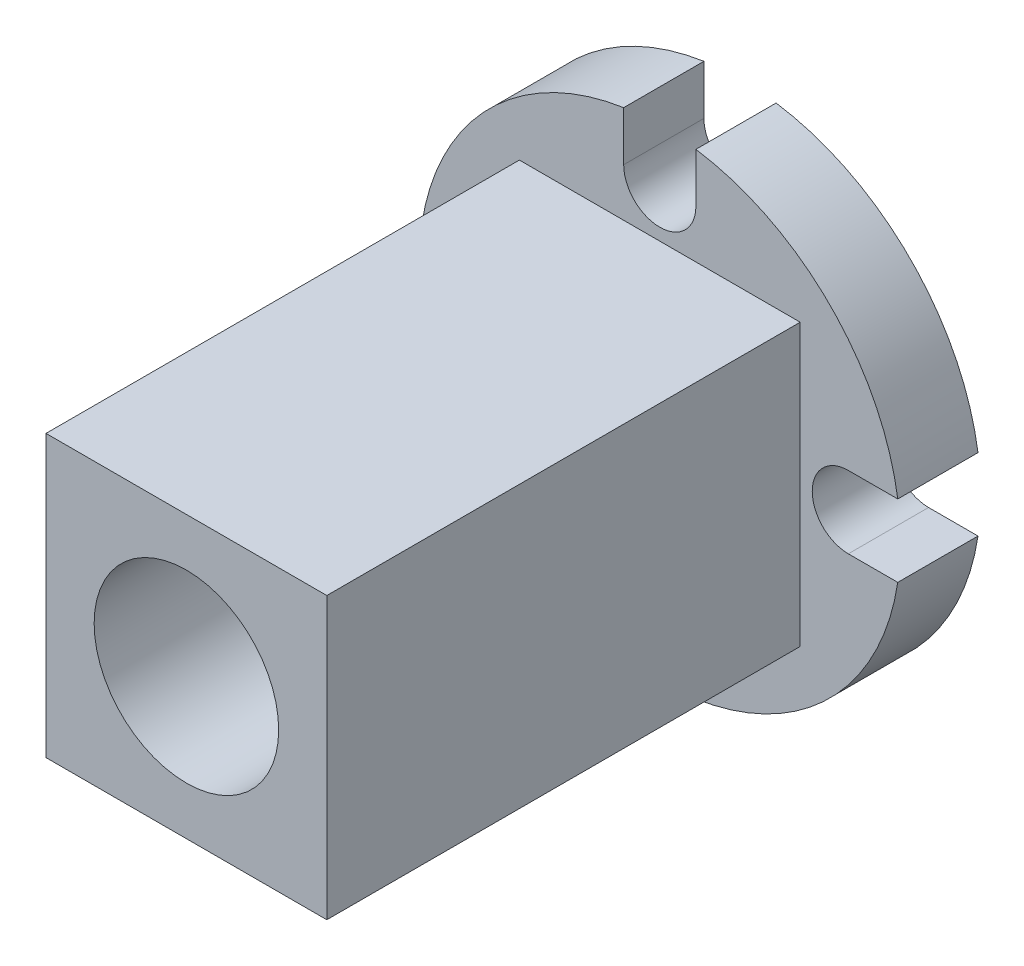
ISO-10303-21;
HEADER;
FILE_DESCRIPTION(('STEP AP214'),'2;1');
FILE_NAME('part.step','',(''),(''),'','','');
FILE_SCHEMA(('AUTOMOTIVE_DESIGN { 1 0 10303 214 1 1 1 1 }'));
ENDSEC;
DATA;
#1=APPLICATION_CONTEXT('core data for automotive mechanical design processes');
#2=APPLICATION_PROTOCOL_DEFINITION('international standard','automotive_design',2000,#1);
#3=PRODUCT_CONTEXT('',#1,'mechanical');
#4=PRODUCT('Part','Part','',(#3));
#5=PRODUCT_RELATED_PRODUCT_CATEGORY('part','',(#4));
#6=PRODUCT_DEFINITION_FORMATION('','',#4);
#7=PRODUCT_DEFINITION_CONTEXT('part definition',#1,'design');
#8=PRODUCT_DEFINITION('design','',#6,#7);
#9=PRODUCT_DEFINITION_SHAPE('','',#8);
#10=(LENGTH_UNIT() NAMED_UNIT(*) SI_UNIT(.MILLI.,.METRE.));
#11=(NAMED_UNIT(*) PLANE_ANGLE_UNIT() SI_UNIT($,.RADIAN.));
#12=(NAMED_UNIT(*) SI_UNIT($,.STERADIAN.) SOLID_ANGLE_UNIT());
#13=UNCERTAINTY_MEASURE_WITH_UNIT(LENGTH_MEASURE(1.E-05),#10,'distance_accuracy_value','');
#14=(GEOMETRIC_REPRESENTATION_CONTEXT(3) GLOBAL_UNCERTAINTY_ASSIGNED_CONTEXT((#13)) GLOBAL_UNIT_ASSIGNED_CONTEXT((#10,
#11,#12)) REPRESENTATION_CONTEXT('',''));
#15=CARTESIAN_POINT('',(0.,0.,0.));
#16=DIRECTION('',(0.,0.,1.));
#17=DIRECTION('',(1.,0.,0.));
#18=AXIS2_PLACEMENT_3D('',#15,#16,#17);
#19=CARTESIAN_POINT('',(-17.5,17.5,69.));
#20=DIRECTION('',(0.,0.,1.));
#21=DIRECTION('',(0.,-1.,0.));
#22=AXIS2_PLACEMENT_3D('',#19,#20,#21);
#23=PLANE('',#22);
#24=CARTESIAN_POINT('',(0.,0.,69.));
#25=DIRECTION('',(0.,0.,1.));
#26=DIRECTION('',(1.,0.,0.));
#27=AXIS2_PLACEMENT_3D('',#24,#25,#26);
#28=CIRCLE('',#27,11.5);
#29=CARTESIAN_POINT('',(11.5,0.,69.));
#30=VERTEX_POINT('',#29);
#31=EDGE_CURVE('E422',#30,#30,#28,.T.);
#32=ORIENTED_EDGE('',*,*,#31,.F.);
#33=EDGE_LOOP('',(#32));
#34=FACE_BOUND('',#33,.T.);
#35=DIRECTION('',(-1.,0.,0.));
#36=VECTOR('',#35,1.);
#37=CARTESIAN_POINT('',(17.5,17.5,69.));
#38=LINE('',#37,#36);
#39=CARTESIAN_POINT('',(17.5,17.5,69.));
#40=VERTEX_POINT('',#39);
#41=CARTESIAN_POINT('',(-17.5,17.5,69.));
#42=VERTEX_POINT('',#41);
#43=EDGE_CURVE('E402',#40,#42,#38,.T.);
#44=ORIENTED_EDGE('',*,*,#43,.T.);
#45=DIRECTION('',(0.,-1.,0.));
#46=VECTOR('',#45,1.);
#47=CARTESIAN_POINT('',(-17.5,17.5,69.));
#48=LINE('',#47,#46);
#49=CARTESIAN_POINT('',(-17.5,-17.5,69.));
#50=VERTEX_POINT('',#49);
#51=EDGE_CURVE('E417',#42,#50,#48,.T.);
#52=ORIENTED_EDGE('',*,*,#51,.T.);
#53=DIRECTION('',(1.,0.,0.));
#54=VECTOR('',#53,1.);
#55=CARTESIAN_POINT('',(17.5,-17.5,69.));
#56=LINE('',#55,#54);
#57=CARTESIAN_POINT('',(17.5,-17.5,69.));
#58=VERTEX_POINT('',#57);
#59=EDGE_CURVE('E414',#50,#58,#56,.T.);
#60=ORIENTED_EDGE('',*,*,#59,.T.);
#61=DIRECTION('',(0.,1.,0.));
#62=VECTOR('',#61,1.);
#63=CARTESIAN_POINT('',(17.5,17.5,69.));
#64=LINE('',#63,#62);
#65=EDGE_CURVE('E399',#58,#40,#64,.T.);
#66=ORIENTED_EDGE('',*,*,#65,.T.);
#67=EDGE_LOOP('',(#44,#52,#60,#66));
#68=FACE_BOUND('',#67,.T.);
#69=ADVANCED_FACE('F14',(#34,#68),#23,.T.);
#70=CARTESIAN_POINT('',(0.,0.,10.));
#71=DIRECTION('',(0.,0.,1.));
#72=DIRECTION('',(0.,-1.,0.));
#73=AXIS2_PLACEMENT_3D('',#70,#71,#72);
#74=PLANE('',#73);
#75=CARTESIAN_POINT('',(0.,0.,10.));
#76=DIRECTION('',(0.,0.,1.));
#77=DIRECTION('',(0.,-1.,0.));
#78=AXIS2_PLACEMENT_3D('',#75,#76,#77);
#79=CIRCLE('',#78,30.);
#80=CARTESIAN_POINT('',(29.6605798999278,4.5,10.));
#81=VERTEX_POINT('',#80);
#82=CARTESIAN_POINT('',(4.5,29.6605798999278,10.));
#83=VERTEX_POINT('',#82);
#84=EDGE_CURVE('E205',#81,#83,#79,.T.);
#85=ORIENTED_EDGE('',*,*,#84,.T.);
#86=DIRECTION('',(0.,-1.,0.));
#87=VECTOR('',#86,1.);
#88=CARTESIAN_POINT('',(4.5,29.6605798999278,10.));
#89=LINE('',#88,#87);
#90=CARTESIAN_POINT('',(4.5,23.5,10.));
#91=VERTEX_POINT('',#90);
#92=EDGE_CURVE('E104',#83,#91,#89,.T.);
#93=ORIENTED_EDGE('',*,*,#92,.T.);
#94=CARTESIAN_POINT('',(0.,23.5,10.));
#95=DIRECTION('',(0.,0.,-1.));
#96=DIRECTION('',(0.,-1.,0.));
#97=AXIS2_PLACEMENT_3D('',#94,#95,#96);
#98=CIRCLE('',#97,4.5);
#99=CARTESIAN_POINT('',(-4.5,23.5,10.));
#100=VERTEX_POINT('',#99);
#101=EDGE_CURVE('E360',#91,#100,#98,.T.);
#102=ORIENTED_EDGE('',*,*,#101,.T.);
#103=DIRECTION('',(0.,1.,0.));
#104=VECTOR('',#103,1.);
#105=CARTESIAN_POINT('',(-4.5,29.6605798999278,10.));
#106=LINE('',#105,#104);
#107=CARTESIAN_POINT('',(-4.5,29.6605798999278,10.));
#108=VERTEX_POINT('',#107);
#109=EDGE_CURVE('E362',#100,#108,#106,.T.);
#110=ORIENTED_EDGE('',*,*,#109,.T.);
#111=CARTESIAN_POINT('',(0.,0.,10.));
#112=DIRECTION('',(0.,0.,1.));
#113=DIRECTION('',(0.,-1.,0.));
#114=AXIS2_PLACEMENT_3D('',#111,#112,#113);
#115=CIRCLE('',#114,30.);
#116=CARTESIAN_POINT('',(-29.6605798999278,4.5,10.));
#117=VERTEX_POINT('',#116);
#118=EDGE_CURVE('E364',#108,#117,#115,.T.);
#119=ORIENTED_EDGE('',*,*,#118,.T.);
#120=DIRECTION('',(1.,0.,0.));
#121=VECTOR('',#120,1.);
#122=CARTESIAN_POINT('',(-29.6605798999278,4.5,10.));
#123=LINE('',#122,#121);
#124=CARTESIAN_POINT('',(-23.5,4.5,10.));
#125=VERTEX_POINT('',#124);
#126=EDGE_CURVE('E370',#117,#125,#123,.T.);
#127=ORIENTED_EDGE('',*,*,#126,.T.);
#128=CARTESIAN_POINT('',(-23.5,0.,10.));
#129=DIRECTION('',(0.,0.,-1.));
#130=DIRECTION('',(0.,-1.,0.));
#131=AXIS2_PLACEMENT_3D('',#128,#129,#130);
#132=CIRCLE('',#131,4.5);
#133=CARTESIAN_POINT('',(-23.5,-4.5,10.));
#134=VERTEX_POINT('',#133);
#135=EDGE_CURVE('E372',#125,#134,#132,.T.);
#136=ORIENTED_EDGE('',*,*,#135,.T.);
#137=DIRECTION('',(-1.,0.,0.));
#138=VECTOR('',#137,1.);
#139=CARTESIAN_POINT('',(-29.6605798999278,-4.5,10.));
#140=LINE('',#139,#138);
#141=CARTESIAN_POINT('',(-29.6605798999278,-4.5,10.));
#142=VERTEX_POINT('',#141);
#143=EDGE_CURVE('E374',#134,#142,#140,.T.);
#144=ORIENTED_EDGE('',*,*,#143,.T.);
#145=CARTESIAN_POINT('',(0.,0.,10.));
#146=DIRECTION('',(0.,0.,1.));
#147=DIRECTION('',(0.,-1.,0.));
#148=AXIS2_PLACEMENT_3D('',#145,#146,#147);
#149=CIRCLE('',#148,30.);
#150=CARTESIAN_POINT('',(-4.5,-29.6605798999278,10.));
#151=VERTEX_POINT('',#150);
#152=EDGE_CURVE('E376',#142,#151,#149,.T.);
#153=ORIENTED_EDGE('',*,*,#152,.T.);
#154=DIRECTION('',(0.,1.,0.));
#155=VECTOR('',#154,1.);
#156=CARTESIAN_POINT('',(-4.5,-29.6605798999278,10.));
#157=LINE('',#156,#155);
#158=CARTESIAN_POINT('',(-4.5,-23.5,10.));
#159=VERTEX_POINT('',#158);
#160=EDGE_CURVE('E378',#151,#159,#157,.T.);
#161=ORIENTED_EDGE('',*,*,#160,.T.);
#162=CARTESIAN_POINT('',(0.,-23.5,10.));
#163=DIRECTION('',(0.,0.,-1.));
#164=DIRECTION('',(0.,-1.,0.));
#165=AXIS2_PLACEMENT_3D('',#162,#163,#164);
#166=CIRCLE('',#165,4.5);
#167=CARTESIAN_POINT('',(4.5,-23.5,10.));
#168=VERTEX_POINT('',#167);
#169=EDGE_CURVE('E380',#159,#168,#166,.T.);
#170=ORIENTED_EDGE('',*,*,#169,.T.);
#171=DIRECTION('',(0.,-1.,0.));
#172=VECTOR('',#171,1.);
#173=CARTESIAN_POINT('',(4.5,-29.6605798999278,10.));
#174=LINE('',#173,#172);
#175=CARTESIAN_POINT('',(4.5,-29.6605798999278,10.));
#176=VERTEX_POINT('',#175);
#177=EDGE_CURVE('E382',#168,#176,#174,.T.);
#178=ORIENTED_EDGE('',*,*,#177,.T.);
#179=CARTESIAN_POINT('',(0.,0.,10.));
#180=DIRECTION('',(0.,0.,1.));
#181=DIRECTION('',(0.,-1.,0.));
#182=AXIS2_PLACEMENT_3D('',#179,#180,#181);
#183=CIRCLE('',#182,30.);
#184=CARTESIAN_POINT('',(29.6605798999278,-4.5,10.));
#185=VERTEX_POINT('',#184);
#186=EDGE_CURVE('E152',#176,#185,#183,.T.);
#187=ORIENTED_EDGE('',*,*,#186,.T.);
#188=DIRECTION('',(-1.,0.,0.));
#189=VECTOR('',#188,1.);
#190=CARTESIAN_POINT('',(29.6605798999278,-4.5,10.));
#191=LINE('',#190,#189);
#192=CARTESIAN_POINT('',(23.5,-4.5,10.));
#193=VERTEX_POINT('',#192);
#194=EDGE_CURVE('E144',#185,#193,#191,.T.);
#195=ORIENTED_EDGE('',*,*,#194,.T.);
#196=CARTESIAN_POINT('',(23.5,0.,10.));
#197=DIRECTION('',(0.,0.,-1.));
#198=DIRECTION('',(0.,-1.,0.));
#199=AXIS2_PLACEMENT_3D('',#196,#197,#198);
#200=CIRCLE('',#199,4.5);
#201=CARTESIAN_POINT('',(23.5,4.5,10.));
#202=VERTEX_POINT('',#201);
#203=EDGE_CURVE('E149',#193,#202,#200,.T.);
#204=ORIENTED_EDGE('',*,*,#203,.T.);
#205=DIRECTION('',(1.,0.,0.));
#206=VECTOR('',#205,1.);
#207=CARTESIAN_POINT('',(29.6605798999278,4.5,10.));
#208=LINE('',#207,#206);
#209=EDGE_CURVE('E38',#202,#81,#208,.T.);
#210=ORIENTED_EDGE('',*,*,#209,.T.);
#211=EDGE_LOOP('',(#85,#93,#102,#110,#119,#127,#136,#144,#153,#161,#170,#178,#187,#195,#204,#210));
#212=FACE_BOUND('',#211,.T.);
#213=DIRECTION('',(0.,-1.,0.));
#214=VECTOR('',#213,1.);
#215=CARTESIAN_POINT('',(-17.5,17.5,10.));
#216=LINE('',#215,#214);
#217=CARTESIAN_POINT('',(-17.5,17.5,10.));
#218=VERTEX_POINT('',#217);
#219=CARTESIAN_POINT('',(-17.5,-17.5,10.));
#220=VERTEX_POINT('',#219);
#221=EDGE_CURVE('E405',#218,#220,#216,.T.);
#222=ORIENTED_EDGE('',*,*,#221,.F.);
#223=DIRECTION('',(-1.,0.,0.));
#224=VECTOR('',#223,1.);
#225=CARTESIAN_POINT('',(17.5,17.5,10.));
#226=LINE('',#225,#224);
#227=CARTESIAN_POINT('',(17.5,17.5,10.));
#228=VERTEX_POINT('',#227);
#229=EDGE_CURVE('E408',#228,#218,#226,.T.);
#230=ORIENTED_EDGE('',*,*,#229,.F.);
#231=DIRECTION('',(0.,1.,0.));
#232=VECTOR('',#231,1.);
#233=CARTESIAN_POINT('',(17.5,17.5,10.));
#234=LINE('',#233,#232);
#235=CARTESIAN_POINT('',(17.5,-17.5,10.));
#236=VERTEX_POINT('',#235);
#237=EDGE_CURVE('E400',#236,#228,#234,.T.);
#238=ORIENTED_EDGE('',*,*,#237,.F.);
#239=DIRECTION('',(1.,0.,0.));
#240=VECTOR('',#239,1.);
#241=CARTESIAN_POINT('',(17.5,-17.5,10.));
#242=LINE('',#241,#240);
#243=EDGE_CURVE('E403',#220,#236,#242,.T.);
#244=ORIENTED_EDGE('',*,*,#243,.F.);
#245=EDGE_LOOP('',(#222,#230,#238,#244));
#246=FACE_BOUND('',#245,.T.);
#247=ADVANCED_FACE('F146',(#212,#246),#74,.T.);
#248=CARTESIAN_POINT('',(0.,0.,10.));
#249=DIRECTION('',(0.,0.,-1.));
#250=DIRECTION('',(0.,1.,0.));
#251=AXIS2_PLACEMENT_3D('',#248,#249,#250);
#252=CYLINDRICAL_SURFACE('',#251,30.);
#253=CARTESIAN_POINT('',(0.,0.,0.));
#254=DIRECTION('',(0.,0.,1.));
#255=DIRECTION('',(0.,-1.,0.));
#256=AXIS2_PLACEMENT_3D('',#253,#254,#255);
#257=CIRCLE('',#256,30.);
#258=CARTESIAN_POINT('',(29.6605798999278,4.5,0.));
#259=VERTEX_POINT('',#258);
#260=CARTESIAN_POINT('',(4.5,29.6605798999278,0.));
#261=VERTEX_POINT('',#260);
#262=EDGE_CURVE('E173',#259,#261,#257,.T.);
#263=ORIENTED_EDGE('',*,*,#262,.T.);
#264=DIRECTION('',(0.,0.,-1.));
#265=VECTOR('',#264,1.);
#266=CARTESIAN_POINT('',(4.5,29.6605798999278,10.));
#267=LINE('',#266,#265);
#268=EDGE_CURVE('E242',#83,#261,#267,.T.);
#269=ORIENTED_EDGE('',*,*,#268,.F.);
#270=ORIENTED_EDGE('',*,*,#84,.F.);
#271=DIRECTION('',(0.,0.,-1.));
#272=VECTOR('',#271,1.);
#273=CARTESIAN_POINT('',(29.6605798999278,4.5,10.));
#274=LINE('',#273,#272);
#275=EDGE_CURVE('E169',#81,#259,#274,.T.);
#276=ORIENTED_EDGE('',*,*,#275,.T.);
#277=EDGE_LOOP('',(#263,#269,#270,#276));
#278=FACE_BOUND('',#277,.T.);
#279=ADVANCED_FACE('F267',(#278),#252,.T.);
#280=CARTESIAN_POINT('',(4.5,29.6605798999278,10.));
#281=DIRECTION('',(1.,0.,0.));
#282=DIRECTION('',(0.,0.,1.));
#283=AXIS2_PLACEMENT_3D('',#280,#281,#282);
#284=PLANE('',#283);
#285=DIRECTION('',(0.,-1.,0.));
#286=VECTOR('',#285,1.);
#287=CARTESIAN_POINT('',(4.5,29.6605798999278,0.));
#288=LINE('',#287,#286);
#289=CARTESIAN_POINT('',(4.5,23.5,0.));
#290=VERTEX_POINT('',#289);
#291=EDGE_CURVE('E176',#261,#290,#288,.T.);
#292=ORIENTED_EDGE('',*,*,#291,.T.);
#293=DIRECTION('',(0.,0.,-1.));
#294=VECTOR('',#293,1.);
#295=CARTESIAN_POINT('',(4.5,23.5,10.));
#296=LINE('',#295,#294);
#297=EDGE_CURVE('E239',#91,#290,#296,.T.);
#298=ORIENTED_EDGE('',*,*,#297,.F.);
#299=ORIENTED_EDGE('',*,*,#92,.F.);
#300=ORIENTED_EDGE('',*,*,#268,.T.);
#301=EDGE_LOOP('',(#292,#298,#299,#300));
#302=FACE_BOUND('',#301,.T.);
#303=ADVANCED_FACE('F344',(#302),#284,.F.);
#304=CARTESIAN_POINT('',(0.,23.5,10.));
#305=DIRECTION('',(0.,0.,-1.));
#306=DIRECTION('',(0.,1.,0.));
#307=AXIS2_PLACEMENT_3D('',#304,#305,#306);
#308=CYLINDRICAL_SURFACE('',#307,4.5);
#309=CARTESIAN_POINT('',(0.,23.5,0.));
#310=DIRECTION('',(0.,0.,-1.));
#311=DIRECTION('',(0.,-1.,0.));
#312=AXIS2_PLACEMENT_3D('',#309,#310,#311);
#313=CIRCLE('',#312,4.5);
#314=CARTESIAN_POINT('',(-4.5,23.5,0.));
#315=VERTEX_POINT('',#314);
#316=EDGE_CURVE('E179',#290,#315,#313,.T.);
#317=ORIENTED_EDGE('',*,*,#316,.T.);
#318=DIRECTION('',(0.,0.,-1.));
#319=VECTOR('',#318,1.);
#320=CARTESIAN_POINT('',(-4.5,23.5,10.));
#321=LINE('',#320,#319);
#322=EDGE_CURVE('E236',#100,#315,#321,.T.);
#323=ORIENTED_EDGE('',*,*,#322,.F.);
#324=ORIENTED_EDGE('',*,*,#101,.F.);
#325=ORIENTED_EDGE('',*,*,#297,.T.);
#326=EDGE_LOOP('',(#317,#323,#324,#325));
#327=FACE_BOUND('',#326,.T.);
#328=ADVANCED_FACE('F340',(#327),#308,.F.);
#329=CARTESIAN_POINT('',(-4.5,29.6605798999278,10.));
#330=DIRECTION('',(-1.,0.,0.));
#331=DIRECTION('',(0.,0.,-1.));
#332=AXIS2_PLACEMENT_3D('',#329,#330,#331);
#333=PLANE('',#332);
#334=DIRECTION('',(0.,1.,0.));
#335=VECTOR('',#334,1.);
#336=CARTESIAN_POINT('',(-4.5,29.6605798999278,0.));
#337=LINE('',#336,#335);
#338=CARTESIAN_POINT('',(-4.5,29.6605798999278,0.));
#339=VERTEX_POINT('',#338);
#340=EDGE_CURVE('E181',#315,#339,#337,.T.);
#341=ORIENTED_EDGE('',*,*,#340,.T.);
#342=DIRECTION('',(0.,0.,-1.));
#343=VECTOR('',#342,1.);
#344=CARTESIAN_POINT('',(-4.5,29.6605798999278,10.));
#345=LINE('',#344,#343);
#346=EDGE_CURVE('E233',#108,#339,#345,.T.);
#347=ORIENTED_EDGE('',*,*,#346,.F.);
#348=ORIENTED_EDGE('',*,*,#109,.F.);
#349=ORIENTED_EDGE('',*,*,#322,.T.);
#350=EDGE_LOOP('',(#341,#347,#348,#349));
#351=FACE_BOUND('',#350,.T.);
#352=ADVANCED_FACE('F336',(#351),#333,.F.);
#353=CARTESIAN_POINT('',(0.,0.,10.));
#354=DIRECTION('',(0.,0.,-1.));
#355=DIRECTION('',(0.,1.,0.));
#356=AXIS2_PLACEMENT_3D('',#353,#354,#355);
#357=CYLINDRICAL_SURFACE('',#356,30.);
#358=CARTESIAN_POINT('',(0.,0.,0.));
#359=DIRECTION('',(0.,0.,1.));
#360=DIRECTION('',(0.,-1.,0.));
#361=AXIS2_PLACEMENT_3D('',#358,#359,#360);
#362=CIRCLE('',#361,30.);
#363=CARTESIAN_POINT('',(-29.6605798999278,4.5,0.));
#364=VERTEX_POINT('',#363);
#365=EDGE_CURVE('E183',#339,#364,#362,.T.);
#366=ORIENTED_EDGE('',*,*,#365,.T.);
#367=DIRECTION('',(0.,0.,-1.));
#368=VECTOR('',#367,1.);
#369=CARTESIAN_POINT('',(-29.6605798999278,4.5,10.));
#370=LINE('',#369,#368);
#371=EDGE_CURVE('E230',#117,#364,#370,.T.);
#372=ORIENTED_EDGE('',*,*,#371,.F.);
#373=ORIENTED_EDGE('',*,*,#118,.F.);
#374=ORIENTED_EDGE('',*,*,#346,.T.);
#375=EDGE_LOOP('',(#366,#372,#373,#374));
#376=FACE_BOUND('',#375,.T.);
#377=ADVANCED_FACE('F332',(#376),#357,.T.);
#378=CARTESIAN_POINT('',(-29.6605798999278,4.5,10.));
#379=DIRECTION('',(0.,1.,0.));
#380=DIRECTION('',(-1.,0.,0.));
#381=AXIS2_PLACEMENT_3D('',#378,#379,#380);
#382=PLANE('',#381);
#383=DIRECTION('',(1.,0.,0.));
#384=VECTOR('',#383,1.);
#385=CARTESIAN_POINT('',(-29.6605798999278,4.5,0.));
#386=LINE('',#385,#384);
#387=CARTESIAN_POINT('',(-23.5,4.5,0.));
#388=VERTEX_POINT('',#387);
#389=EDGE_CURVE('E185',#364,#388,#386,.T.);
#390=ORIENTED_EDGE('',*,*,#389,.T.);
#391=DIRECTION('',(0.,0.,-1.));
#392=VECTOR('',#391,1.);
#393=CARTESIAN_POINT('',(-23.5,4.5,10.));
#394=LINE('',#393,#392);
#395=EDGE_CURVE('E227',#125,#388,#394,.T.);
#396=ORIENTED_EDGE('',*,*,#395,.F.);
#397=ORIENTED_EDGE('',*,*,#126,.F.);
#398=ORIENTED_EDGE('',*,*,#371,.T.);
#399=EDGE_LOOP('',(#390,#396,#397,#398));
#400=FACE_BOUND('',#399,.T.);
#401=ADVANCED_FACE('F328',(#400),#382,.F.);
#402=CARTESIAN_POINT('',(-23.5,0.,10.));
#403=DIRECTION('',(0.,0.,-1.));
#404=DIRECTION('',(0.,1.,0.));
#405=AXIS2_PLACEMENT_3D('',#402,#403,#404);
#406=CYLINDRICAL_SURFACE('',#405,4.5);
#407=CARTESIAN_POINT('',(-23.5,0.,0.));
#408=DIRECTION('',(0.,0.,-1.));
#409=DIRECTION('',(0.,-1.,0.));
#410=AXIS2_PLACEMENT_3D('',#407,#408,#409);
#411=CIRCLE('',#410,4.5);
#412=CARTESIAN_POINT('',(-23.5,-4.5,0.));
#413=VERTEX_POINT('',#412);
#414=EDGE_CURVE('E187',#388,#413,#411,.T.);
#415=ORIENTED_EDGE('',*,*,#414,.T.);
#416=DIRECTION('',(0.,0.,-1.));
#417=VECTOR('',#416,1.);
#418=CARTESIAN_POINT('',(-23.5,-4.5,10.));
#419=LINE('',#418,#417);
#420=EDGE_CURVE('E224',#134,#413,#419,.T.);
#421=ORIENTED_EDGE('',*,*,#420,.F.);
#422=ORIENTED_EDGE('',*,*,#135,.F.);
#423=ORIENTED_EDGE('',*,*,#395,.T.);
#424=EDGE_LOOP('',(#415,#421,#422,#423));
#425=FACE_BOUND('',#424,.T.);
#426=ADVANCED_FACE('F324',(#425),#406,.F.);
#427=CARTESIAN_POINT('',(-29.6605798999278,-4.5,10.));
#428=DIRECTION('',(0.,-1.,0.));
#429=DIRECTION('',(1.,0.,0.));
#430=AXIS2_PLACEMENT_3D('',#427,#428,#429);
#431=PLANE('',#430);
#432=DIRECTION('',(-1.,0.,0.));
#433=VECTOR('',#432,1.);
#434=CARTESIAN_POINT('',(-29.6605798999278,-4.5,0.));
#435=LINE('',#434,#433);
#436=CARTESIAN_POINT('',(-29.6605798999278,-4.5,0.));
#437=VERTEX_POINT('',#436);
#438=EDGE_CURVE('E189',#413,#437,#435,.T.);
#439=ORIENTED_EDGE('',*,*,#438,.T.);
#440=DIRECTION('',(0.,0.,-1.));
#441=VECTOR('',#440,1.);
#442=CARTESIAN_POINT('',(-29.6605798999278,-4.5,10.));
#443=LINE('',#442,#441);
#444=EDGE_CURVE('E221',#142,#437,#443,.T.);
#445=ORIENTED_EDGE('',*,*,#444,.F.);
#446=ORIENTED_EDGE('',*,*,#143,.F.);
#447=ORIENTED_EDGE('',*,*,#420,.T.);
#448=EDGE_LOOP('',(#439,#445,#446,#447));
#449=FACE_BOUND('',#448,.T.);
#450=ADVANCED_FACE('F320',(#449),#431,.F.);
#451=CARTESIAN_POINT('',(0.,0.,10.));
#452=DIRECTION('',(0.,0.,-1.));
#453=DIRECTION('',(0.,1.,0.));
#454=AXIS2_PLACEMENT_3D('',#451,#452,#453);
#455=CYLINDRICAL_SURFACE('',#454,30.);
#456=CARTESIAN_POINT('',(0.,0.,0.));
#457=DIRECTION('',(0.,0.,1.));
#458=DIRECTION('',(0.,-1.,0.));
#459=AXIS2_PLACEMENT_3D('',#456,#457,#458);
#460=CIRCLE('',#459,30.);
#461=CARTESIAN_POINT('',(-4.5,-29.6605798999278,0.));
#462=VERTEX_POINT('',#461);
#463=EDGE_CURVE('E191',#437,#462,#460,.T.);
#464=ORIENTED_EDGE('',*,*,#463,.T.);
#465=DIRECTION('',(0.,0.,-1.));
#466=VECTOR('',#465,1.);
#467=CARTESIAN_POINT('',(-4.5,-29.6605798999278,10.));
#468=LINE('',#467,#466);
#469=EDGE_CURVE('E218',#151,#462,#468,.T.);
#470=ORIENTED_EDGE('',*,*,#469,.F.);
#471=ORIENTED_EDGE('',*,*,#152,.F.);
#472=ORIENTED_EDGE('',*,*,#444,.T.);
#473=EDGE_LOOP('',(#464,#470,#471,#472));
#474=FACE_BOUND('',#473,.T.);
#475=ADVANCED_FACE('F316',(#474),#455,.T.);
#476=CARTESIAN_POINT('',(-4.5,-29.6605798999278,10.));
#477=DIRECTION('',(-1.,0.,0.));
#478=DIRECTION('',(0.,-1.,0.));
#479=AXIS2_PLACEMENT_3D('',#476,#477,#478);
#480=PLANE('',#479);
#481=DIRECTION('',(0.,1.,0.));
#482=VECTOR('',#481,1.);
#483=CARTESIAN_POINT('',(-4.5,-29.6605798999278,0.));
#484=LINE('',#483,#482);
#485=CARTESIAN_POINT('',(-4.5,-23.5,0.));
#486=VERTEX_POINT('',#485);
#487=EDGE_CURVE('E193',#462,#486,#484,.T.);
#488=ORIENTED_EDGE('',*,*,#487,.T.);
#489=DIRECTION('',(0.,0.,-1.));
#490=VECTOR('',#489,1.);
#491=CARTESIAN_POINT('',(-4.5,-23.5,10.));
#492=LINE('',#491,#490);
#493=EDGE_CURVE('E215',#159,#486,#492,.T.);
#494=ORIENTED_EDGE('',*,*,#493,.F.);
#495=ORIENTED_EDGE('',*,*,#160,.F.);
#496=ORIENTED_EDGE('',*,*,#469,.T.);
#497=EDGE_LOOP('',(#488,#494,#495,#496));
#498=FACE_BOUND('',#497,.T.);
#499=ADVANCED_FACE('F312',(#498),#480,.F.);
#500=CARTESIAN_POINT('',(0.,-23.5,10.));
#501=DIRECTION('',(0.,0.,-1.));
#502=DIRECTION('',(0.,1.,0.));
#503=AXIS2_PLACEMENT_3D('',#500,#501,#502);
#504=CYLINDRICAL_SURFACE('',#503,4.5);
#505=CARTESIAN_POINT('',(0.,-23.5,0.));
#506=DIRECTION('',(0.,0.,-1.));
#507=DIRECTION('',(0.,-1.,0.));
#508=AXIS2_PLACEMENT_3D('',#505,#506,#507);
#509=CIRCLE('',#508,4.5);
#510=CARTESIAN_POINT('',(4.5,-23.5,0.));
#511=VERTEX_POINT('',#510);
#512=EDGE_CURVE('E195',#486,#511,#509,.T.);
#513=ORIENTED_EDGE('',*,*,#512,.T.);
#514=DIRECTION('',(0.,0.,-1.));
#515=VECTOR('',#514,1.);
#516=CARTESIAN_POINT('',(4.5,-23.5,10.));
#517=LINE('',#516,#515);
#518=EDGE_CURVE('E212',#168,#511,#517,.T.);
#519=ORIENTED_EDGE('',*,*,#518,.F.);
#520=ORIENTED_EDGE('',*,*,#169,.F.);
#521=ORIENTED_EDGE('',*,*,#493,.T.);
#522=EDGE_LOOP('',(#513,#519,#520,#521));
#523=FACE_BOUND('',#522,.T.);
#524=ADVANCED_FACE('F308',(#523),#504,.F.);
#525=CARTESIAN_POINT('',(4.5,-29.6605798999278,10.));
#526=DIRECTION('',(1.,0.,0.));
#527=DIRECTION('',(0.,1.,0.));
#528=AXIS2_PLACEMENT_3D('',#525,#526,#527);
#529=PLANE('',#528);
#530=DIRECTION('',(0.,-1.,0.));
#531=VECTOR('',#530,1.);
#532=CARTESIAN_POINT('',(4.5,-29.6605798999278,0.));
#533=LINE('',#532,#531);
#534=CARTESIAN_POINT('',(4.5,-29.6605798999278,0.));
#535=VERTEX_POINT('',#534);
#536=EDGE_CURVE('E197',#511,#535,#533,.T.);
#537=ORIENTED_EDGE('',*,*,#536,.T.);
#538=DIRECTION('',(0.,0.,-1.));
#539=VECTOR('',#538,1.);
#540=CARTESIAN_POINT('',(4.5,-29.6605798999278,10.));
#541=LINE('',#540,#539);
#542=EDGE_CURVE('E209',#176,#535,#541,.T.);
#543=ORIENTED_EDGE('',*,*,#542,.F.);
#544=ORIENTED_EDGE('',*,*,#177,.F.);
#545=ORIENTED_EDGE('',*,*,#518,.T.);
#546=EDGE_LOOP('',(#537,#543,#544,#545));
#547=FACE_BOUND('',#546,.T.);
#548=ADVANCED_FACE('F304',(#547),#529,.F.);
#549=CARTESIAN_POINT('',(0.,0.,10.));
#550=DIRECTION('',(0.,0.,-1.));
#551=DIRECTION('',(0.,1.,0.));
#552=AXIS2_PLACEMENT_3D('',#549,#550,#551);
#553=CYLINDRICAL_SURFACE('',#552,30.);
#554=CARTESIAN_POINT('',(0.,0.,0.));
#555=DIRECTION('',(0.,0.,1.));
#556=DIRECTION('',(0.,-1.,0.));
#557=AXIS2_PLACEMENT_3D('',#554,#555,#556);
#558=CIRCLE('',#557,30.);
#559=CARTESIAN_POINT('',(29.6605798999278,-4.5,0.));
#560=VERTEX_POINT('',#559);
#561=EDGE_CURVE('E199',#535,#560,#558,.T.);
#562=ORIENTED_EDGE('',*,*,#561,.T.);
#563=DIRECTION('',(0.,0.,-1.));
#564=VECTOR('',#563,1.);
#565=CARTESIAN_POINT('',(29.6605798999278,-4.5,10.));
#566=LINE('',#565,#564);
#567=EDGE_CURVE('E164',#185,#560,#566,.T.);
#568=ORIENTED_EDGE('',*,*,#567,.F.);
#569=ORIENTED_EDGE('',*,*,#186,.F.);
#570=ORIENTED_EDGE('',*,*,#542,.T.);
#571=EDGE_LOOP('',(#562,#568,#569,#570));
#572=FACE_BOUND('',#571,.T.);
#573=ADVANCED_FACE('F301',(#572),#553,.T.);
#574=CARTESIAN_POINT('',(29.6605798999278,-4.5,10.));
#575=DIRECTION('',(0.,-1.,0.));
#576=DIRECTION('',(1.,0.,0.));
#577=AXIS2_PLACEMENT_3D('',#574,#575,#576);
#578=PLANE('',#577);
#579=DIRECTION('',(-1.,0.,0.));
#580=VECTOR('',#579,1.);
#581=CARTESIAN_POINT('',(29.6605798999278,-4.5,0.));
#582=LINE('',#581,#580);
#583=CARTESIAN_POINT('',(23.5,-4.5,0.));
#584=VERTEX_POINT('',#583);
#585=EDGE_CURVE('E161',#560,#584,#582,.T.);
#586=ORIENTED_EDGE('',*,*,#585,.T.);
#587=DIRECTION('',(0.,0.,-1.));
#588=VECTOR('',#587,1.);
#589=CARTESIAN_POINT('',(23.5,-4.5,10.));
#590=LINE('',#589,#588);
#591=EDGE_CURVE('E158',#193,#584,#590,.T.);
#592=ORIENTED_EDGE('',*,*,#591,.F.);
#593=ORIENTED_EDGE('',*,*,#194,.F.);
#594=ORIENTED_EDGE('',*,*,#567,.T.);
#595=EDGE_LOOP('',(#586,#592,#593,#594));
#596=FACE_BOUND('',#595,.T.);
#597=ADVANCED_FACE('F159',(#596),#578,.F.);
#598=CARTESIAN_POINT('',(23.5,0.,10.));
#599=DIRECTION('',(0.,0.,-1.));
#600=DIRECTION('',(0.,1.,0.));
#601=AXIS2_PLACEMENT_3D('',#598,#599,#600);
#602=CYLINDRICAL_SURFACE('',#601,4.5);
#603=CARTESIAN_POINT('',(23.5,0.,0.));
#604=DIRECTION('',(0.,0.,-1.));
#605=DIRECTION('',(0.,-1.,0.));
#606=AXIS2_PLACEMENT_3D('',#603,#604,#605);
#607=CIRCLE('',#606,4.5);
#608=CARTESIAN_POINT('',(23.5,4.5,0.));
#609=VERTEX_POINT('',#608);
#610=EDGE_CURVE('E202',#584,#609,#607,.T.);
#611=ORIENTED_EDGE('',*,*,#610,.T.);
#612=DIRECTION('',(0.,0.,-1.));
#613=VECTOR('',#612,1.);
#614=CARTESIAN_POINT('',(23.5,4.5,10.));
#615=LINE('',#614,#613);
#616=EDGE_CURVE('E165',#202,#609,#615,.T.);
#617=ORIENTED_EDGE('',*,*,#616,.F.);
#618=ORIENTED_EDGE('',*,*,#203,.F.);
#619=ORIENTED_EDGE('',*,*,#591,.T.);
#620=EDGE_LOOP('',(#611,#617,#618,#619));
#621=FACE_BOUND('',#620,.T.);
#622=ADVANCED_FACE('F167',(#621),#602,.F.);
#623=CARTESIAN_POINT('',(29.6605798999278,4.5,10.));
#624=DIRECTION('',(0.,1.,0.));
#625=DIRECTION('',(-1.,0.,0.));
#626=AXIS2_PLACEMENT_3D('',#623,#624,#625);
#627=PLANE('',#626);
#628=DIRECTION('',(1.,0.,0.));
#629=VECTOR('',#628,1.);
#630=CARTESIAN_POINT('',(29.6605798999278,4.5,0.));
#631=LINE('',#630,#629);
#632=EDGE_CURVE('E95',#609,#259,#631,.T.);
#633=ORIENTED_EDGE('',*,*,#632,.T.);
#634=ORIENTED_EDGE('',*,*,#275,.F.);
#635=ORIENTED_EDGE('',*,*,#209,.F.);
#636=ORIENTED_EDGE('',*,*,#616,.T.);
#637=EDGE_LOOP('',(#633,#634,#635,#636));
#638=FACE_BOUND('',#637,.T.);
#639=ADVANCED_FACE('F293',(#638),#627,.F.);
#640=CARTESIAN_POINT('',(0.,0.,0.));
#641=DIRECTION('',(0.,0.,1.));
#642=DIRECTION('',(0.,-1.,0.));
#643=AXIS2_PLACEMENT_3D('',#640,#641,#642);
#644=PLANE('',#643);
#645=CARTESIAN_POINT('',(0.,0.,0.));
#646=DIRECTION('',(0.,0.,1.));
#647=DIRECTION('',(1.,0.,0.));
#648=AXIS2_PLACEMENT_3D('',#645,#646,#647);
#649=CIRCLE('',#648,5.65);
#650=CARTESIAN_POINT('',(5.65,0.,0.));
#651=VERTEX_POINT('',#650);
#652=EDGE_CURVE('E9',#651,#651,#649,.T.);
#653=ORIENTED_EDGE('',*,*,#652,.T.);
#654=EDGE_LOOP('',(#653));
#655=FACE_BOUND('',#654,.T.);
#656=ORIENTED_EDGE('',*,*,#262,.F.);
#657=ORIENTED_EDGE('',*,*,#632,.F.);
#658=ORIENTED_EDGE('',*,*,#610,.F.);
#659=ORIENTED_EDGE('',*,*,#585,.F.);
#660=ORIENTED_EDGE('',*,*,#561,.F.);
#661=ORIENTED_EDGE('',*,*,#536,.F.);
#662=ORIENTED_EDGE('',*,*,#512,.F.);
#663=ORIENTED_EDGE('',*,*,#487,.F.);
#664=ORIENTED_EDGE('',*,*,#463,.F.);
#665=ORIENTED_EDGE('',*,*,#438,.F.);
#666=ORIENTED_EDGE('',*,*,#414,.F.);
#667=ORIENTED_EDGE('',*,*,#389,.F.);
#668=ORIENTED_EDGE('',*,*,#365,.F.);
#669=ORIENTED_EDGE('',*,*,#340,.F.);
#670=ORIENTED_EDGE('',*,*,#316,.F.);
#671=ORIENTED_EDGE('',*,*,#291,.F.);
#672=EDGE_LOOP('',(#656,#657,#658,#659,#660,#661,#662,#663,#664,#665,#666,#667,#668,#669,#670,#671));
#673=FACE_BOUND('',#672,.T.);
#674=ADVANCED_FACE('F288',(#655,#673),#644,.F.);
#675=CARTESIAN_POINT('',(17.5,17.5,69.));
#676=DIRECTION('',(0.,-1.,0.));
#677=DIRECTION('',(1.,0.,0.));
#678=AXIS2_PLACEMENT_3D('',#675,#676,#677);
#679=PLANE('',#678);
#680=ORIENTED_EDGE('',*,*,#229,.T.);
#681=DIRECTION('',(0.,0.,-1.));
#682=VECTOR('',#681,1.);
#683=CARTESIAN_POINT('',(-17.5,17.5,69.));
#684=LINE('',#683,#682);
#685=EDGE_CURVE('E177',#42,#218,#684,.T.);
#686=ORIENTED_EDGE('',*,*,#685,.F.);
#687=ORIENTED_EDGE('',*,*,#43,.F.);
#688=DIRECTION('',(0.,0.,-1.));
#689=VECTOR('',#688,1.);
#690=CARTESIAN_POINT('',(17.5,17.5,69.));
#691=LINE('',#690,#689);
#692=EDGE_CURVE('E396',#40,#228,#691,.T.);
#693=ORIENTED_EDGE('',*,*,#692,.T.);
#694=EDGE_LOOP('',(#680,#686,#687,#693));
#695=FACE_BOUND('',#694,.T.);
#696=ADVANCED_FACE('F285',(#695),#679,.F.);
#697=CARTESIAN_POINT('',(-17.5,17.5,69.));
#698=DIRECTION('',(1.,0.,0.));
#699=DIRECTION('',(0.,0.,1.));
#700=AXIS2_PLACEMENT_3D('',#697,#698,#699);
#701=PLANE('',#700);
#702=ORIENTED_EDGE('',*,*,#221,.T.);
#703=DIRECTION('',(0.,0.,-1.));
#704=VECTOR('',#703,1.);
#705=CARTESIAN_POINT('',(-17.5,-17.5,69.));
#706=LINE('',#705,#704);
#707=EDGE_CURVE('E392',#50,#220,#706,.T.);
#708=ORIENTED_EDGE('',*,*,#707,.F.);
#709=ORIENTED_EDGE('',*,*,#51,.F.);
#710=ORIENTED_EDGE('',*,*,#685,.T.);
#711=EDGE_LOOP('',(#702,#708,#709,#710));
#712=FACE_BOUND('',#711,.T.);
#713=ADVANCED_FACE('F281',(#712),#701,.F.);
#714=CARTESIAN_POINT('',(17.5,-17.5,69.));
#715=DIRECTION('',(0.,1.,0.));
#716=DIRECTION('',(-1.,0.,0.));
#717=AXIS2_PLACEMENT_3D('',#714,#715,#716);
#718=PLANE('',#717);
#719=ORIENTED_EDGE('',*,*,#243,.T.);
#720=DIRECTION('',(0.,0.,-1.));
#721=VECTOR('',#720,1.);
#722=CARTESIAN_POINT('',(17.5,-17.5,69.));
#723=LINE('',#722,#721);
#724=EDGE_CURVE('E29',#58,#236,#723,.T.);
#725=ORIENTED_EDGE('',*,*,#724,.F.);
#726=ORIENTED_EDGE('',*,*,#59,.F.);
#727=ORIENTED_EDGE('',*,*,#707,.T.);
#728=EDGE_LOOP('',(#719,#725,#726,#727));
#729=FACE_BOUND('',#728,.T.);
#730=ADVANCED_FACE('F278',(#729),#718,.F.);
#731=CARTESIAN_POINT('',(17.5,17.5,69.));
#732=DIRECTION('',(-1.,0.,0.));
#733=DIRECTION('',(0.,0.,-1.));
#734=AXIS2_PLACEMENT_3D('',#731,#732,#733);
#735=PLANE('',#734);
#736=ORIENTED_EDGE('',*,*,#237,.T.);
#737=ORIENTED_EDGE('',*,*,#692,.F.);
#738=ORIENTED_EDGE('',*,*,#65,.F.);
#739=ORIENTED_EDGE('',*,*,#724,.T.);
#740=EDGE_LOOP('',(#736,#737,#738,#739));
#741=FACE_BOUND('',#740,.T.);
#742=ADVANCED_FACE('F275',(#741),#735,.F.);
#743=CARTESIAN_POINT('',(0.,0.,49.));
#744=DIRECTION('',(0.,0.,1.));
#745=DIRECTION('',(1.,0.,0.));
#746=AXIS2_PLACEMENT_3D('',#743,#744,#745);
#747=CYLINDRICAL_SURFACE('',#746,11.5);
#748=CARTESIAN_POINT('',(0.,0.,49.));
#749=DIRECTION('',(0.,0.,1.));
#750=DIRECTION('',(1.,0.,0.));
#751=AXIS2_PLACEMENT_3D('',#748,#749,#750);
#752=CIRCLE('',#751,11.5);
#753=CARTESIAN_POINT('',(11.5,0.,49.));
#754=VERTEX_POINT('',#753);
#755=EDGE_CURVE('E411',#754,#754,#752,.T.);
#756=ORIENTED_EDGE('',*,*,#755,.F.);
#757=EDGE_LOOP('',(#756));
#758=FACE_BOUND('',#757,.T.);
#759=ORIENTED_EDGE('',*,*,#31,.T.);
#760=EDGE_LOOP('',(#759));
#761=FACE_BOUND('',#760,.T.);
#762=ADVANCED_FACE('F273',(#758,#761),#747,.F.);
#763=CARTESIAN_POINT('',(0.,0.,49.));
#764=DIRECTION('',(0.,0.,1.));
#765=DIRECTION('',(1.,0.,0.));
#766=AXIS2_PLACEMENT_3D('',#763,#764,#765);
#767=PLANE('',#766);
#768=ORIENTED_EDGE('',*,*,#755,.T.);
#769=EDGE_LOOP('',(#768));
#770=FACE_BOUND('',#769,.T.);
#771=ADVANCED_FACE('F431',(#770),#767,.T.);
#772=CARTESIAN_POINT('',(0.,0.,30.));
#773=DIRECTION('',(0.,0.,-1.));
#774=DIRECTION('',(-1.,0.,0.));
#775=AXIS2_PLACEMENT_3D('',#772,#773,#774);
#776=CYLINDRICAL_SURFACE('',#775,5.);
#777=CARTESIAN_POINT('',(0.,0.,0.649999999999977));
#778=DIRECTION('',(0.,0.,1.));
#779=DIRECTION('',(1.,0.,0.));
#780=AXIS2_PLACEMENT_3D('',#777,#778,#779);
#781=CIRCLE('',#780,5.);
#782=CARTESIAN_POINT('',(5.,0.,0.649999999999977));
#783=VERTEX_POINT('',#782);
#784=EDGE_CURVE('E22',#783,#783,#781,.F.);
#785=ORIENTED_EDGE('',*,*,#784,.T.);
#786=EDGE_LOOP('',(#785));
#787=FACE_BOUND('',#786,.T.);
#788=CARTESIAN_POINT('',(0.,0.,30.));
#789=DIRECTION('',(0.,0.,-1.));
#790=DIRECTION('',(-1.,0.,0.));
#791=AXIS2_PLACEMENT_3D('',#788,#789,#790);
#792=CIRCLE('',#791,5.);
#793=CARTESIAN_POINT('',(-5.,0.,30.));
#794=VERTEX_POINT('',#793);
#795=EDGE_CURVE('E425',#794,#794,#792,.T.);
#796=ORIENTED_EDGE('',*,*,#795,.F.);
#797=EDGE_LOOP('',(#796));
#798=FACE_BOUND('',#797,.T.);
#799=ADVANCED_FACE('F246',(#787,#798),#776,.F.);
#800=CARTESIAN_POINT('',(0.,0.,30.));
#801=DIRECTION('',(0.,0.,-1.));
#802=DIRECTION('',(-1.,0.,0.));
#803=AXIS2_PLACEMENT_3D('',#800,#801,#802);
#804=PLANE('',#803);
#805=ORIENTED_EDGE('',*,*,#795,.T.);
#806=EDGE_LOOP('',(#805));
#807=FACE_BOUND('',#806,.T.);
#808=ADVANCED_FACE('F250',(#807),#804,.T.);
#809=CARTESIAN_POINT('',(0.,0.,0.649999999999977));
#810=DIRECTION('',(0.,0.,-1.));
#811=DIRECTION('',(-1.,0.,0.));
#812=AXIS2_PLACEMENT_3D('',#809,#810,#811);
#813=CONICAL_SURFACE('',#812,5.,0.785398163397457);
#814=ORIENTED_EDGE('',*,*,#652,.F.);
#815=EDGE_LOOP('',(#814));
#816=FACE_BOUND('',#815,.T.);
#817=ORIENTED_EDGE('',*,*,#784,.F.);
#818=EDGE_LOOP('',(#817));
#819=FACE_BOUND('',#818,.T.);
#820=ADVANCED_FACE('F16',(#816,#819),#813,.F.);
#821=CLOSED_SHELL('',(#69,#247,#279,#303,#328,#352,#377,#401,#426,#450,#475,#499,#524,#548,#573,
#597,#622,#639,#674,#696,#713,#730,#742,#762,#771,#799,#808,#820));
#822=MANIFOLD_SOLID_BREP('B1',#821);
#823=ADVANCED_BREP_SHAPE_REPRESENTATION('',(#18,#822),#14);
#824=SHAPE_DEFINITION_REPRESENTATION(#9,#823);
ENDSEC;
END-ISO-10303-21;
